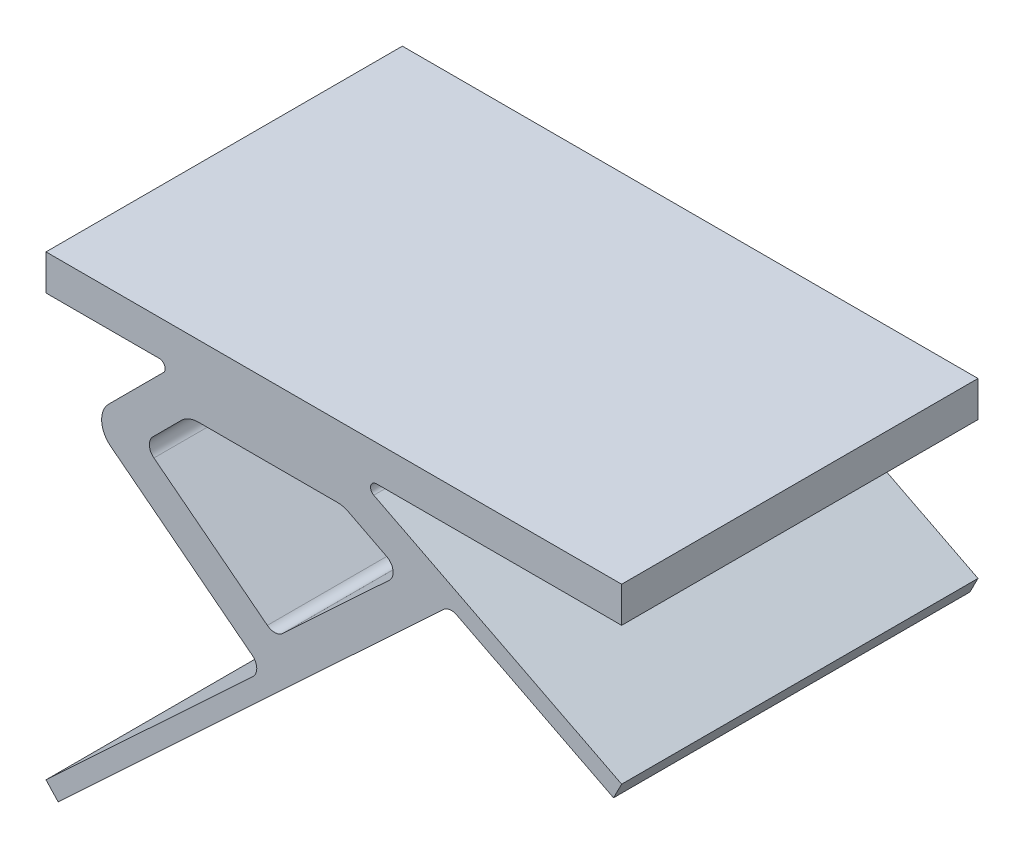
from build123d import *

# Parameters (mm, degrees)
BOSS_EXTRUDE1_DEPTH = 30
FILLET1_R           = 2
FILLET4_R           = 2
FILLET5_R           = 2
FILLET6_R           = 1
FILLET7_R           = 1
FILLET8_R           = 1
FILLET9_R           = 1
FILLET10_R          = 1
FILLET11_R          = 0.5
FILLET12_R          = 0.5


with BuildPart() as part:
    # Sketch1 → Boss-Extrude1 (new body)
    with BuildSketch(Plane.XY):
        Polygon((15, 0), (23.910065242, -4.539904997), (37.720666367, -11.576757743), (37.039680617, -12.91326753), (23.221826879, -5.872719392), (8.568533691, -19.537136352), (-9.71530885, -36.587095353), (-10.73830639, -35.490064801), (7.545536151, -18.440105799), (-7.071067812, -7.071067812), (0, 0), (-10.73830639, 0), (-10.73830639, 3), (37.720666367, 3), (37.720666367, 0), align=None)
        Polygon((1.242640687, -3), (14.279763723, -3), (19.209823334, -5.51199084), (8.568533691, -15.435153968), (-2.546812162, -6.789452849), align=None, mode=Mode.SUBTRACT)
    extrude(amount=BOSS_EXTRUDE1_DEPTH)

    # Fillet1
    fillet1_edges = [part.edges().sort_by_distance(p)[0] for p in [
        (-7.071067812, -7.071067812, 15),
    ]]
    fillet(fillet1_edges, radius=FILLET1_R)

    # Fillet4
    fillet4_edges = [part.edges().sort_by_distance(p)[0] for p in [
        (1.242640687, -3, 15),
    ]]
    fillet(fillet4_edges, radius=FILLET4_R)

    # Fillet5
    fillet5_edges = [part.edges().sort_by_distance(p)[0] for p in [
        (14.279763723, -3, 15),
    ]]
    fillet(fillet5_edges, radius=FILLET5_R)

    # Fillet6
    fillet6_edges = [part.edges().sort_by_distance(p)[0] for p in [
        (-2.546812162, -6.789452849, 15),
    ]]
    fillet(fillet6_edges, radius=FILLET6_R)

    # Fillet7
    fillet7_edges = [part.edges().sort_by_distance(p)[0] for p in [
        (19.209823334, -5.51199084, 15),
    ]]
    fillet(fillet7_edges, radius=FILLET7_R)

    # Fillet8
    fillet8_edges = [part.edges().sort_by_distance(p)[0] for p in [
        (8.568533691, -15.435153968, 15),
    ]]
    fillet(fillet8_edges, radius=FILLET8_R)

    # Fillet9
    fillet9_edges = [part.edges().sort_by_distance(p)[0] for p in [
        (23.221826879, -5.872719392, 15),
    ]]
    fillet(fillet9_edges, radius=FILLET9_R)

    # Fillet10
    fillet10_edges = [part.edges().sort_by_distance(p)[0] for p in [
        (7.545536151, -18.440105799, 15),
    ]]
    fillet(fillet10_edges, radius=FILLET10_R)

    # Fillet11
    fillet11_edges = [part.edges().sort_by_distance(p)[0] for p in [
        (15, 0, 15),
    ]]
    fillet(fillet11_edges, radius=FILLET11_R)

    # Fillet12
    fillet12_edges = [part.edges().sort_by_distance(p)[0] for p in [
        (0, 0, 15),
    ]]
    fillet(fillet12_edges, radius=FILLET12_R)


solid = part.part
